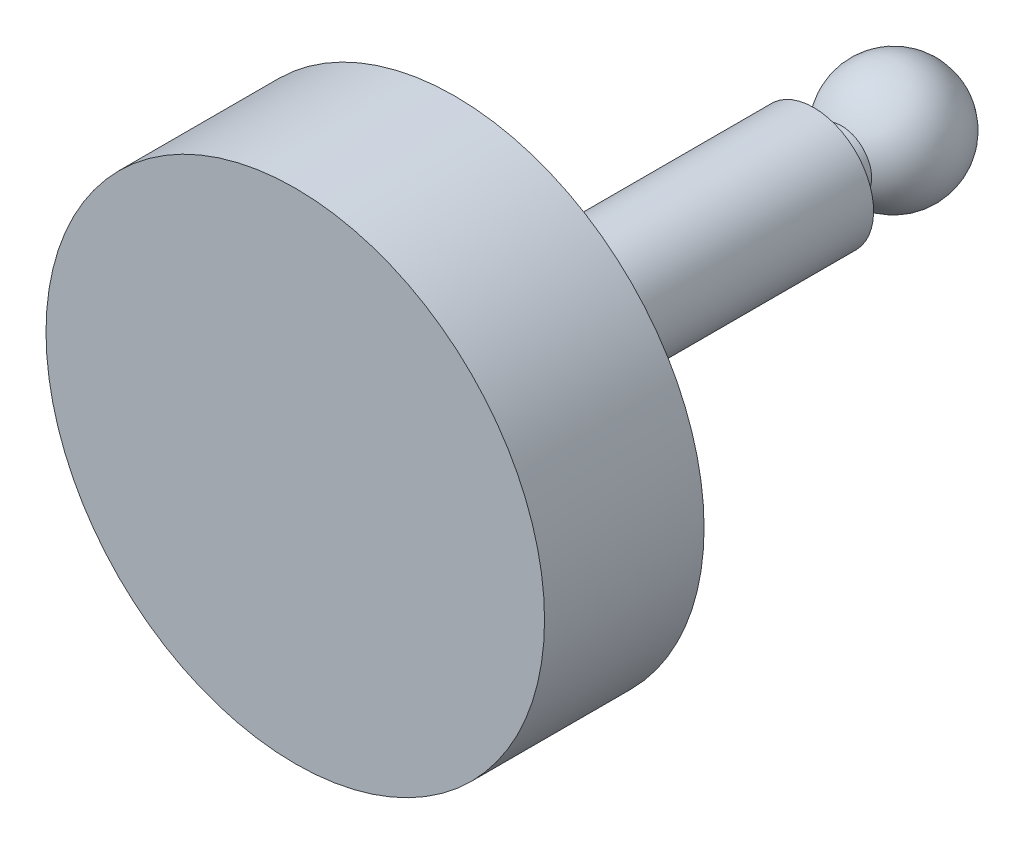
ISO-10303-21;
HEADER;
FILE_DESCRIPTION(('STEP AP214'),'2;1');
FILE_NAME('part.step','',(''),(''),'','','');
FILE_SCHEMA(('AUTOMOTIVE_DESIGN { 1 0 10303 214 1 1 1 1 }'));
ENDSEC;
DATA;
#1=APPLICATION_CONTEXT('core data for automotive mechanical design processes');
#2=APPLICATION_PROTOCOL_DEFINITION('international standard','automotive_design',2000,#1);
#3=PRODUCT_CONTEXT('',#1,'mechanical');
#4=PRODUCT('Part','Part','',(#3));
#5=PRODUCT_RELATED_PRODUCT_CATEGORY('part','',(#4));
#6=PRODUCT_DEFINITION_FORMATION('','',#4);
#7=PRODUCT_DEFINITION_CONTEXT('part definition',#1,'design');
#8=PRODUCT_DEFINITION('design','',#6,#7);
#9=PRODUCT_DEFINITION_SHAPE('','',#8);
#10=(LENGTH_UNIT() NAMED_UNIT(*) SI_UNIT(.MILLI.,.METRE.));
#11=(NAMED_UNIT(*) PLANE_ANGLE_UNIT() SI_UNIT($,.RADIAN.));
#12=(NAMED_UNIT(*) SI_UNIT($,.STERADIAN.) SOLID_ANGLE_UNIT());
#13=UNCERTAINTY_MEASURE_WITH_UNIT(LENGTH_MEASURE(1.E-05),#10,'distance_accuracy_value','');
#14=(GEOMETRIC_REPRESENTATION_CONTEXT(3) GLOBAL_UNCERTAINTY_ASSIGNED_CONTEXT((#13)) GLOBAL_UNIT_ASSIGNED_CONTEXT((#10,
#11,#12)) REPRESENTATION_CONTEXT('',''));
#15=CARTESIAN_POINT('',(0.,0.,0.));
#16=DIRECTION('',(0.,0.,1.));
#17=DIRECTION('',(1.,0.,0.));
#18=AXIS2_PLACEMENT_3D('',#15,#16,#17);
#19=CARTESIAN_POINT('',(0.,-12.5,33.));
#20=DIRECTION('',(0.,0.,-1.));
#21=DIRECTION('',(0.,-1.,0.));
#22=AXIS2_PLACEMENT_3D('',#19,#20,#21);
#23=PLANE('',#22);
#24=CARTESIAN_POINT('',(0.,0.,33.));
#25=DIRECTION('',(0.,0.,1.));
#26=DIRECTION('',(0.,1.,0.));
#27=AXIS2_PLACEMENT_3D('',#24,#25,#26);
#28=CIRCLE('',#27,12.5);
#29=CARTESIAN_POINT('',(0.,12.5,33.));
#30=VERTEX_POINT('',#29);
#31=EDGE_CURVE('E34',#30,#30,#28,.T.);
#32=ORIENTED_EDGE('',*,*,#31,.T.);
#33=EDGE_LOOP('',(#32));
#34=FACE_BOUND('',#33,.T.);
#35=ADVANCED_FACE('F12',(#34),#23,.F.);
#36=CARTESIAN_POINT('',(0.,0.,3.));
#37=DIRECTION('',(0.,-1.,0.));
#38=DIRECTION('',(-1.,0.,0.));
#39=AXIS2_PLACEMENT_3D('',#36,#37,#38);
#40=SPHERICAL_SURFACE('',#39,3.);
#41=CARTESIAN_POINT('',(0.,0.,3.));
#42=DIRECTION('',(0.,0.,1.));
#43=DIRECTION('',(0.,1.,0.));
#44=AXIS2_PLACEMENT_3D('',#41,#42,#43);
#45=SPHERICAL_SURFACE('',#44,3.);
#46=CARTESIAN_POINT('',(0.,0.,5.59807621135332));
#47=DIRECTION('',(0.,0.,1.));
#48=DIRECTION('',(0.,1.,0.));
#49=AXIS2_PLACEMENT_3D('',#46,#47,#48);
#50=CIRCLE('',#49,1.5);
#51=CARTESIAN_POINT('',(0.,1.5,5.59807621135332));
#52=VERTEX_POINT('',#51);
#53=EDGE_CURVE('E8',#52,#52,#50,.T.);
#54=ORIENTED_EDGE('',*,*,#53,.F.);
#55=EDGE_LOOP('',(#54));
#56=FACE_BOUND('',#55,.T.);
#57=ADVANCED_FACE('F63',(#56),#45,.T.);
#58=CARTESIAN_POINT('',(0.,0.,33.));
#59=DIRECTION('',(0.,0.,1.));
#60=DIRECTION('',(0.,1.,0.));
#61=AXIS2_PLACEMENT_3D('',#58,#59,#60);
#62=CYLINDRICAL_SURFACE('',#61,1.5);
#63=ORIENTED_EDGE('',*,*,#53,.T.);
#64=EDGE_LOOP('',(#63));
#65=FACE_BOUND('',#64,.T.);
#66=CARTESIAN_POINT('',(0.,0.,7.));
#67=DIRECTION('',(0.,0.,1.));
#68=DIRECTION('',(0.,1.,0.));
#69=AXIS2_PLACEMENT_3D('',#66,#67,#68);
#70=CIRCLE('',#69,1.5);
#71=CARTESIAN_POINT('',(0.,1.5,7.));
#72=VERTEX_POINT('',#71);
#73=EDGE_CURVE('E18',#72,#72,#70,.T.);
#74=ORIENTED_EDGE('',*,*,#73,.F.);
#75=EDGE_LOOP('',(#74));
#76=FACE_BOUND('',#75,.T.);
#77=ADVANCED_FACE('F60',(#65,#76),#62,.T.);
#78=CARTESIAN_POINT('',(0.,-3.,7.));
#79=DIRECTION('',(0.,0.,-1.));
#80=DIRECTION('',(0.,-1.,0.));
#81=AXIS2_PLACEMENT_3D('',#78,#79,#80);
#82=PLANE('',#81);
#83=ORIENTED_EDGE('',*,*,#73,.T.);
#84=EDGE_LOOP('',(#83));
#85=FACE_BOUND('',#84,.T.);
#86=CARTESIAN_POINT('',(0.,0.,7.));
#87=DIRECTION('',(0.,0.,1.));
#88=DIRECTION('',(0.,1.,0.));
#89=AXIS2_PLACEMENT_3D('',#86,#87,#88);
#90=CIRCLE('',#89,3.);
#91=CARTESIAN_POINT('',(0.,3.,7.));
#92=VERTEX_POINT('',#91);
#93=EDGE_CURVE('E22',#92,#92,#90,.T.);
#94=ORIENTED_EDGE('',*,*,#93,.F.);
#95=EDGE_LOOP('',(#94));
#96=FACE_BOUND('',#95,.T.);
#97=ADVANCED_FACE('F53',(#85,#96),#82,.T.);
#98=CARTESIAN_POINT('',(0.,0.,33.));
#99=DIRECTION('',(0.,0.,1.));
#100=DIRECTION('',(0.,1.,0.));
#101=AXIS2_PLACEMENT_3D('',#98,#99,#100);
#102=CYLINDRICAL_SURFACE('',#101,3.);
#103=ORIENTED_EDGE('',*,*,#93,.T.);
#104=EDGE_LOOP('',(#103));
#105=FACE_BOUND('',#104,.T.);
#106=CARTESIAN_POINT('',(0.,0.,25.));
#107=DIRECTION('',(0.,0.,1.));
#108=DIRECTION('',(0.,1.,0.));
#109=AXIS2_PLACEMENT_3D('',#106,#107,#108);
#110=CIRCLE('',#109,3.);
#111=CARTESIAN_POINT('',(0.,3.,25.));
#112=VERTEX_POINT('',#111);
#113=EDGE_CURVE('E26',#112,#112,#110,.T.);
#114=ORIENTED_EDGE('',*,*,#113,.F.);
#115=EDGE_LOOP('',(#114));
#116=FACE_BOUND('',#115,.T.);
#117=ADVANCED_FACE('F48',(#105,#116),#102,.T.);
#118=CARTESIAN_POINT('',(0.,-3.,25.));
#119=DIRECTION('',(0.,0.,1.));
#120=DIRECTION('',(0.,1.,0.));
#121=AXIS2_PLACEMENT_3D('',#118,#119,#120);
#122=PLANE('',#121);
#123=CARTESIAN_POINT('',(0.,0.,25.));
#124=DIRECTION('',(0.,0.,1.));
#125=DIRECTION('',(0.,1.,0.));
#126=AXIS2_PLACEMENT_3D('',#123,#124,#125);
#127=CIRCLE('',#126,12.5);
#128=CARTESIAN_POINT('',(0.,12.5,25.));
#129=VERTEX_POINT('',#128);
#130=EDGE_CURVE('E31',#129,#129,#127,.T.);
#131=ORIENTED_EDGE('',*,*,#130,.F.);
#132=EDGE_LOOP('',(#131));
#133=FACE_BOUND('',#132,.T.);
#134=ORIENTED_EDGE('',*,*,#113,.T.);
#135=EDGE_LOOP('',(#134));
#136=FACE_BOUND('',#135,.T.);
#137=ADVANCED_FACE('F42',(#133,#136),#122,.F.);
#138=CARTESIAN_POINT('',(0.,0.,33.));
#139=DIRECTION('',(0.,0.,1.));
#140=DIRECTION('',(0.,1.,0.));
#141=AXIS2_PLACEMENT_3D('',#138,#139,#140);
#142=CYLINDRICAL_SURFACE('',#141,12.5);
#143=ORIENTED_EDGE('',*,*,#31,.F.);
#144=EDGE_LOOP('',(#143));
#145=FACE_BOUND('',#144,.T.);
#146=ORIENTED_EDGE('',*,*,#130,.T.);
#147=EDGE_LOOP('',(#146));
#148=FACE_BOUND('',#147,.T.);
#149=ADVANCED_FACE('F39',(#145,#148),#142,.T.);
#150=CLOSED_SHELL('',(#35,#57,#77,#97,#117,#137,#149));
#151=MANIFOLD_SOLID_BREP('B1',#150);
#152=ADVANCED_BREP_SHAPE_REPRESENTATION('',(#18,#151),#14);
#153=SHAPE_DEFINITION_REPRESENTATION(#9,#152);
ENDSEC;
END-ISO-10303-21;
